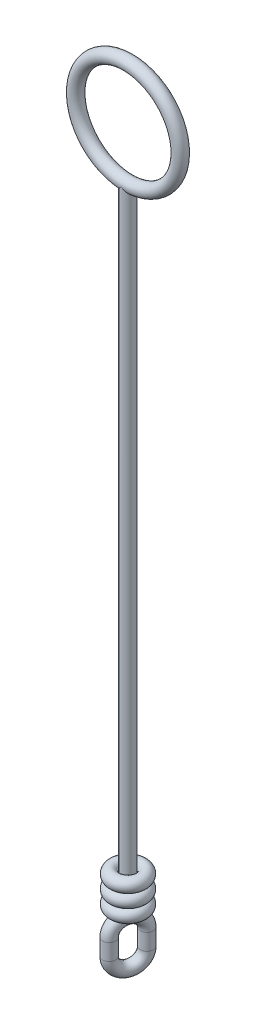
from build123d import *

# Parameters (mm, degrees)
SKETCH_2_R = 0.4
SKETCH_4_R = 0.4
SKETCH_6_R = 0.4
SKETCH_7_R = 0.4


with BuildPart() as part:
    # Sweep 1: sweep along a path in Sketch 1
    with BuildLine(Plane.XY) as sweep_1_path:
        CenterArc((0, 0), 3.2, 0, 360)
    # Sketch 2 → Sweep 1 (sweep)
    with BuildSketch(Plane(origin=(0, 0, 0), x_dir=(1, 0, 0), z_dir=(0, 1, 0))):
        with Locations((-3.2, 0)):
            Circle(SKETCH_2_R)
    sweep(path=sweep_1_path.line)

    # Sweep 2: sweep along a path in Sketch 3
    with BuildLine(Plane.XY) as sweep_2_path:
        Line((0, -3.2), (0, -42))
    # Sketch 4 → Sweep 2 (sweep)
    with BuildSketch(Plane(origin=(0, -42, 0), x_dir=(-1, 0, 0), z_dir=(0, 1, 0))):
        Circle(SKETCH_4_R)
    sweep(path=sweep_2_path.line)

    # Sweep 3: sweep along a path in Sketch 5
    with BuildLine(Plane(origin=(0, 0, 0), x_dir=(-0.34202014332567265, 0, 0.939692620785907), z_dir=(-0.939692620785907, 0, -0.34202014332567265))) as sweep_3_path:
        Line((-0.9, -42.9), (-0.9, -43.9))
        ThreePointArc((-0.9, -43.9), (0, -44.8), (0.9, -43.9))
        Line((0.9, -43.9), (0.9, -42.9))
        ThreePointArc((0.9, -42.9), (0, -42), (-0.9, -42.9))
    # Sketch 6 → Sweep 3 (sweep)
    with BuildSketch(Plane(origin=(0, -42.9, 0), x_dir=(-1, 0, 0), z_dir=(0, 1, 0))):
        with Locations((-0.307818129, -0.845723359)):
            Circle(SKETCH_6_R)
    sweep(path=sweep_3_path.line)


with BuildPart() as body_2:
    # Sketch 7 → Revolve 1 (revolve)
    with BuildSketch(Plane(origin=(0, 0, 0), x_dir=(-0.34202014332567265, 0, 0.939692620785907), z_dir=(-0.939692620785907, 0, -0.34202014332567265)), mode=Mode.PRIVATE) as revolve_1_sk:
        with Locations((-0.8, -41.4)):
            Circle(SKETCH_7_R)
        with Locations((-0.8, -40.6)):
            Circle(SKETCH_7_R)
        with Locations((-0.8, -39.8)):
            Circle(SKETCH_7_R)
    revolve(revolve_1_sk.sketch.rotate(Axis((0, -42.9, 0), (0, 1, 0)), 270), axis=Axis((0, -42.9, 0), (0, 1, 0)))


solid = Compound([part.part, body_2.part])
